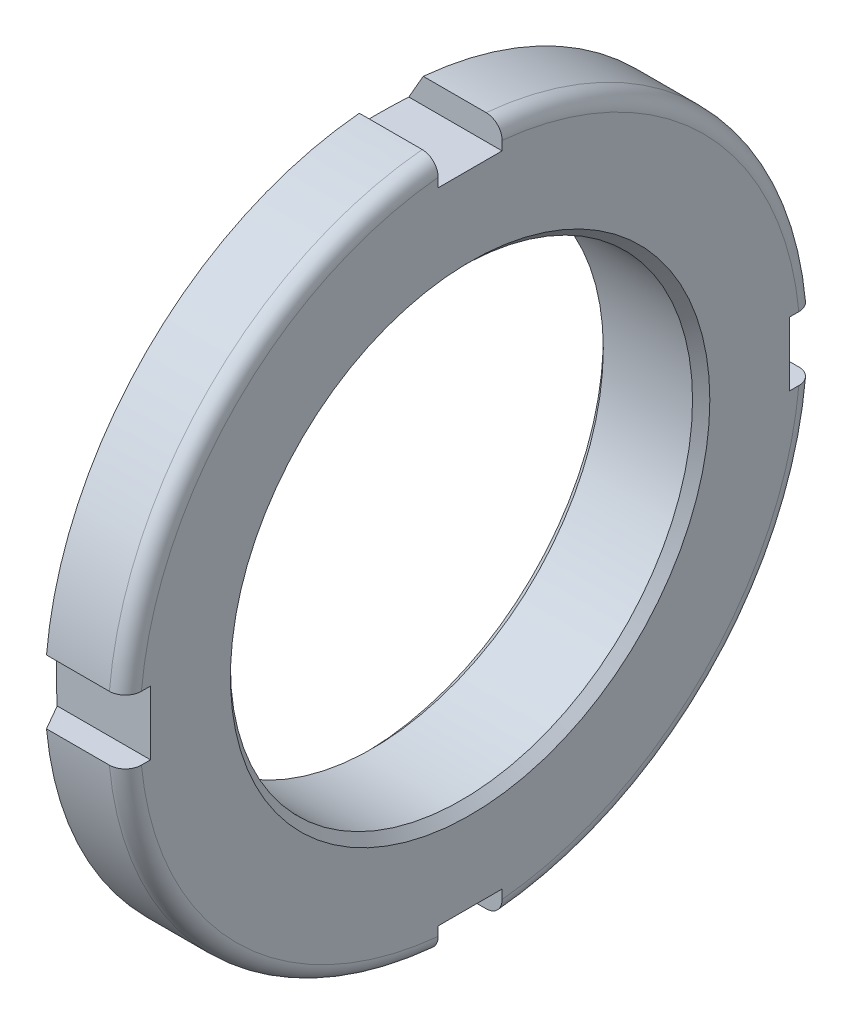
ISO-10303-21;
HEADER;
FILE_DESCRIPTION(('STEP AP214'),'2;1');
FILE_NAME('part.step','',(''),(''),'','','');
FILE_SCHEMA(('AUTOMOTIVE_DESIGN { 1 0 10303 214 1 1 1 1 }'));
ENDSEC;
DATA;
#1=APPLICATION_CONTEXT('core data for automotive mechanical design processes');
#2=APPLICATION_PROTOCOL_DEFINITION('international standard','automotive_design',2000,#1);
#3=PRODUCT_CONTEXT('',#1,'mechanical');
#4=PRODUCT('Part','Part','',(#3));
#5=PRODUCT_RELATED_PRODUCT_CATEGORY('part','',(#4));
#6=PRODUCT_DEFINITION_FORMATION('','',#4);
#7=PRODUCT_DEFINITION_CONTEXT('part definition',#1,'design');
#8=PRODUCT_DEFINITION('design','',#6,#7);
#9=PRODUCT_DEFINITION_SHAPE('','',#8);
#10=(LENGTH_UNIT() NAMED_UNIT(*) SI_UNIT(.MILLI.,.METRE.));
#11=(NAMED_UNIT(*) PLANE_ANGLE_UNIT() SI_UNIT($,.RADIAN.));
#12=(NAMED_UNIT(*) SI_UNIT($,.STERADIAN.) SOLID_ANGLE_UNIT());
#13=UNCERTAINTY_MEASURE_WITH_UNIT(LENGTH_MEASURE(1.E-05),#10,'distance_accuracy_value','');
#14=(GEOMETRIC_REPRESENTATION_CONTEXT(3) GLOBAL_UNCERTAINTY_ASSIGNED_CONTEXT((#13)) GLOBAL_UNIT_ASSIGNED_CONTEXT((#10,
#11,#12)) REPRESENTATION_CONTEXT('',''));
#15=CARTESIAN_POINT('',(0.,0.,0.));
#16=DIRECTION('',(0.,0.,1.));
#17=DIRECTION('',(1.,0.,0.));
#18=AXIS2_PLACEMENT_3D('',#15,#16,#17);
#19=CARTESIAN_POINT('',(0.,0.,0.));
#20=DIRECTION('',(1.,0.,0.));
#21=DIRECTION('',(0.,0.,-1.));
#22=AXIS2_PLACEMENT_3D('',#19,#20,#21);
#23=CYLINDRICAL_SURFACE('',#22,32.5);
#24=DIRECTION('',(1.,0.,0.));
#25=VECTOR('',#24,1.);
#26=CARTESIAN_POINT('',(-0.000999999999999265,3.,32.3612422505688));
#27=LINE('',#26,#25);
#28=CARTESIAN_POINT('',(2.59807621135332,3.,32.3612422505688));
#29=VERTEX_POINT('',#28);
#30=CARTESIAN_POINT('',(8.5,3.,32.3612422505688));
#31=VERTEX_POINT('',#30);
#32=EDGE_CURVE('E176',#29,#31,#27,.T.);
#33=ORIENTED_EDGE('',*,*,#32,.T.);
#34=CARTESIAN_POINT('',(8.5,0.,0.));
#35=DIRECTION('',(1.,0.,0.));
#36=DIRECTION('',(0.,0.,-1.));
#37=AXIS2_PLACEMENT_3D('',#34,#35,#36);
#38=CIRCLE('',#37,32.5);
#39=CARTESIAN_POINT('',(8.5,32.3612422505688,3.));
#40=VERTEX_POINT('',#39);
#41=EDGE_CURVE('E51',#31,#40,#38,.F.);
#42=ORIENTED_EDGE('',*,*,#41,.T.);
#43=DIRECTION('',(1.,0.,0.));
#44=VECTOR('',#43,1.);
#45=CARTESIAN_POINT('',(-0.000999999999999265,32.3612422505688,3.));
#46=LINE('',#45,#44);
#47=CARTESIAN_POINT('',(2.59807621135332,32.3612422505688,3.));
#48=VERTEX_POINT('',#47);
#49=EDGE_CURVE('E196',#48,#40,#46,.T.);
#50=ORIENTED_EDGE('',*,*,#49,.F.);
#51=CARTESIAN_POINT('',(2.59807621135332,0.,0.));
#52=DIRECTION('',(1.,0.,0.));
#53=DIRECTION('',(0.,0.,-1.));
#54=AXIS2_PLACEMENT_3D('',#51,#52,#53);
#55=CIRCLE('',#54,32.5);
#56=EDGE_CURVE('E191',#48,#29,#55,.T.);
#57=ORIENTED_EDGE('',*,*,#56,.T.);
#58=EDGE_LOOP('',(#33,#42,#50,#57));
#59=FACE_BOUND('',#58,.T.);
#60=ADVANCED_FACE('F37',(#59),#23,.T.);
#61=DIRECTION('',(1.,0.,0.));
#62=VECTOR('',#61,1.);
#63=CARTESIAN_POINT('',(-0.000999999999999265,32.3612422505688,-3.));
#64=LINE('',#63,#62);
#65=CARTESIAN_POINT('',(2.59807621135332,32.3612422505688,-3.));
#66=VERTEX_POINT('',#65);
#67=CARTESIAN_POINT('',(8.5,32.3612422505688,-3.));
#68=VERTEX_POINT('',#67);
#69=EDGE_CURVE('E389',#66,#68,#64,.T.);
#70=ORIENTED_EDGE('',*,*,#69,.T.);
#71=CARTESIAN_POINT('',(8.5,0.,0.));
#72=DIRECTION('',(1.,0.,0.));
#73=DIRECTION('',(0.,0.,-1.));
#74=AXIS2_PLACEMENT_3D('',#71,#72,#73);
#75=CIRCLE('',#74,32.5);
#76=CARTESIAN_POINT('',(8.5,3.,-32.3612422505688));
#77=VERTEX_POINT('',#76);
#78=EDGE_CURVE('E331',#68,#77,#75,.F.);
#79=ORIENTED_EDGE('',*,*,#78,.T.);
#80=DIRECTION('',(1.,0.,0.));
#81=VECTOR('',#80,1.);
#82=CARTESIAN_POINT('',(-0.000999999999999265,3.,-32.3612422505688));
#83=LINE('',#82,#81);
#84=CARTESIAN_POINT('',(2.59807621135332,3.,-32.3612422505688));
#85=VERTEX_POINT('',#84);
#86=EDGE_CURVE('E289',#85,#77,#83,.T.);
#87=ORIENTED_EDGE('',*,*,#86,.F.);
#88=EDGE_CURVE('E197',#85,#66,#55,.T.);
#89=ORIENTED_EDGE('',*,*,#88,.T.);
#90=EDGE_LOOP('',(#70,#79,#87,#89));
#91=FACE_BOUND('',#90,.T.);
#92=ADVANCED_FACE('F415',(#91),#23,.T.);
#93=DIRECTION('',(1.,0.,0.));
#94=VECTOR('',#93,1.);
#95=CARTESIAN_POINT('',(-0.000999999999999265,-3.,-32.3612422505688));
#96=LINE('',#95,#94);
#97=CARTESIAN_POINT('',(2.59807621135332,-3.,-32.3612422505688));
#98=VERTEX_POINT('',#97);
#99=CARTESIAN_POINT('',(8.5,-3.,-32.3612422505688));
#100=VERTEX_POINT('',#99);
#101=EDGE_CURVE('E290',#98,#100,#96,.T.);
#102=ORIENTED_EDGE('',*,*,#101,.T.);
#103=CARTESIAN_POINT('',(8.5,0.,0.));
#104=DIRECTION('',(1.,0.,0.));
#105=DIRECTION('',(0.,0.,-1.));
#106=AXIS2_PLACEMENT_3D('',#103,#104,#105);
#107=CIRCLE('',#106,32.5);
#108=CARTESIAN_POINT('',(8.5,-32.3612422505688,-3.));
#109=VERTEX_POINT('',#108);
#110=EDGE_CURVE('E248',#100,#109,#107,.F.);
#111=ORIENTED_EDGE('',*,*,#110,.T.);
#112=DIRECTION('',(1.,0.,0.));
#113=VECTOR('',#112,1.);
#114=CARTESIAN_POINT('',(-0.000999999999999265,-32.3612422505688,-3.));
#115=LINE('',#114,#113);
#116=CARTESIAN_POINT('',(2.59807621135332,-32.3612422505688,-3.));
#117=VERTEX_POINT('',#116);
#118=EDGE_CURVE('E455',#117,#109,#115,.T.);
#119=ORIENTED_EDGE('',*,*,#118,.F.);
#120=EDGE_CURVE('E201',#117,#98,#55,.T.);
#121=ORIENTED_EDGE('',*,*,#120,.T.);
#122=EDGE_LOOP('',(#102,#111,#119,#121));
#123=FACE_BOUND('',#122,.T.);
#124=ADVANCED_FACE('F421',(#123),#23,.T.);
#125=CARTESIAN_POINT('',(2.59807621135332,0.,0.));
#126=DIRECTION('',(1.,0.,0.));
#127=DIRECTION('',(0.,0.,-1.));
#128=AXIS2_PLACEMENT_3D('',#125,#126,#127);
#129=CONICAL_SURFACE('',#128,32.5,1.0471975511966);
#130=CARTESIAN_POINT('',(-0.774586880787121,3.,26.4890358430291));
#131=CARTESIAN_POINT('',(-0.32581777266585,3.,27.2712863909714));
#132=CARTESIAN_POINT('',(0.123132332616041,3.,28.0534330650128));
#133=CARTESIAN_POINT('',(1.02132867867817,3.,29.6175562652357));
#134=CARTESIAN_POINT('',(1.47057491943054,3.,30.3995327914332));
#135=CARTESIAN_POINT('',(2.36929774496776,3.,31.9633534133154));
#136=CARTESIAN_POINT('',(2.81877432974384,3.,32.7451975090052));
#137=CARTESIAN_POINT('',(3.71791618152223,3.,34.3087772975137));
#138=CARTESIAN_POINT('',(4.16758144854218,3.,35.0905129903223));
#139=CARTESIAN_POINT('',(4.61732017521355,3.,35.8722064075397));
#140=B_SPLINE_CURVE_WITH_KNOTS('',3,(#130,#131,#132,#133,#134,#135,#136,#137,#138,#139),
.UNSPECIFIED.,.F.,.F.,(4,2,2,2,4),(0.,2.70551035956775,5.41102046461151,8.11653046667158,
10.8220407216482),.UNSPECIFIED.);
#141=CARTESIAN_POINT('',(1.24108764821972,3.,30.));
#142=VERTEX_POINT('',#141);
#143=EDGE_CURVE('E179',#142,#29,#140,.T.);
#144=ORIENTED_EDGE('',*,*,#143,.T.);
#145=ORIENTED_EDGE('',*,*,#56,.F.);
#146=CARTESIAN_POINT('',(4.61732017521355,35.8722064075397,3.));
#147=CARTESIAN_POINT('',(4.16758144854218,35.0905129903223,3.));
#148=CARTESIAN_POINT('',(3.71791618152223,34.3087772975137,3.));
#149=CARTESIAN_POINT('',(2.81877432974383,32.7451975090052,3.));
#150=CARTESIAN_POINT('',(2.36929774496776,31.9633534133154,3.));
#151=CARTESIAN_POINT('',(1.47057491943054,30.3995327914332,3.));
#152=CARTESIAN_POINT('',(1.02132867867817,29.6175562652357,3.));
#153=CARTESIAN_POINT('',(0.123132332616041,28.0534330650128,3.));
#154=CARTESIAN_POINT('',(-0.32581777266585,27.2712863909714,3.));
#155=CARTESIAN_POINT('',(-0.774586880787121,26.4890358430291,3.));
#156=B_SPLINE_CURVE_WITH_KNOTS('',3,(#146,#147,#148,#149,#150,#151,#152,#153,#154,#155),
.UNSPECIFIED.,.F.,.F.,(4,2,2,2,4),(0.,2.70551025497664,5.41102025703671,8.11653036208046,
10.8220407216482),.UNSPECIFIED.);
#157=CARTESIAN_POINT('',(1.24108764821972,30.,3.));
#158=VERTEX_POINT('',#157);
#159=EDGE_CURVE('E392',#48,#158,#156,.T.);
#160=ORIENTED_EDGE('',*,*,#159,.T.);
#161=CARTESIAN_POINT('',(2.0091193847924,30.,9.53854841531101));
#162=CARTESIAN_POINT('',(1.94715724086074,30.,9.1843653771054));
#163=CARTESIAN_POINT('',(1.88824040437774,30.,8.82965466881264));
#164=CARTESIAN_POINT('',(1.77674003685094,30.,8.11922925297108));
#165=CARTESIAN_POINT('',(1.7241566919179,30.,7.76351451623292));
#166=CARTESIAN_POINT('',(1.57626286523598,30.,6.69487651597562));
#167=CARTESIAN_POINT('',(1.49082542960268,30.,5.98055498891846));
#168=CARTESIAN_POINT('',(1.34796251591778,30.,4.54901032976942));
#169=CARTESIAN_POINT('',(1.29054111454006,30.,3.8317867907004));
#170=CARTESIAN_POINT('',(1.20494432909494,30.,2.39563575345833));
#171=CARTESIAN_POINT('',(1.17676666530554,30.,1.67670839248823));
#172=CARTESIAN_POINT('',(1.15044970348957,30.,0.24783869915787));
#173=CARTESIAN_POINT('',(1.15191712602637,30.,-0.462096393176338));
#174=CARTESIAN_POINT('',(1.18389595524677,30.,-1.88134655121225));
#175=CARTESIAN_POINT('',(1.21440883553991,30.,-2.59066158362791));
#176=CARTESIAN_POINT('',(1.30379852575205,30.,-4.00709347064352));
#177=CARTESIAN_POINT('',(1.362659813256,30.,-4.71421131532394));
#178=CARTESIAN_POINT('',(1.50753008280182,30.,-6.12558663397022));
#179=CARTESIAN_POINT('',(1.59353590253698,30.,-6.82984443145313));
#180=CARTESIAN_POINT('',(1.71583714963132,30.,-7.6997457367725));
#181=CARTESIAN_POINT('',(1.74011054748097,30.,-7.86713611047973));
#182=CARTESIAN_POINT('',(1.79007957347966,30.,-8.20169134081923));
#183=CARTESIAN_POINT('',(1.81577507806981,30.,-8.36885621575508));
#184=CARTESIAN_POINT('',(1.86860796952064,30.,-8.70323687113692));
#185=CARTESIAN_POINT('',(1.89574763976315,30.,-8.87045228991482));
#186=CARTESIAN_POINT('',(1.95140614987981,30.,-9.20466733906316));
#187=CARTESIAN_POINT('',(1.97992510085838,30.,-9.37166695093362));
#188=CARTESIAN_POINT('',(2.0091193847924,30.,-9.53854841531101));
#189=B_SPLINE_CURVE_WITH_KNOTS('',3,(#161,#162,#163,#164,#165,#166,#167,#168,#169,#170,#171,
#172,#173,#174,#175,#176,#177,#178,#179,#180,#181,#182,#183,#184,#185,#186,#187,#188),
.UNSPECIFIED.,.F.,.F.,(4,2,2,2,2,2,2,2,2,2,2,2,2,4),(0.,1.07866075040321,2.15735318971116,
4.31502889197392,6.47301846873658,8.63083980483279,10.7600539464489,12.889376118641,
15.0175336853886,17.145443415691,17.652864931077,18.1602424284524,18.668447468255,
19.1766935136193),.UNSPECIFIED.);
#190=CARTESIAN_POINT('',(1.24108764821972,30.,-3.));
#191=VERTEX_POINT('',#190);
#192=EDGE_CURVE('E376',#158,#191,#189,.T.);
#193=ORIENTED_EDGE('',*,*,#192,.T.);
#194=CARTESIAN_POINT('',(-0.774586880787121,26.4890358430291,-3.));
#195=CARTESIAN_POINT('',(-0.32581777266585,27.2712863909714,-3.));
#196=CARTESIAN_POINT('',(0.123132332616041,28.0534330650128,-3.));
#197=CARTESIAN_POINT('',(1.02132867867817,29.6175562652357,-3.));
#198=CARTESIAN_POINT('',(1.47057491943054,30.3995327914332,-3.));
#199=CARTESIAN_POINT('',(2.36929774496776,31.9633534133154,-3.));
#200=CARTESIAN_POINT('',(2.81877432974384,32.7451975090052,-3.));
#201=CARTESIAN_POINT('',(3.71791618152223,34.3087772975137,-3.));
#202=CARTESIAN_POINT('',(4.16758144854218,35.0905129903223,-3.));
#203=CARTESIAN_POINT('',(4.61732017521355,35.8722064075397,-3.));
#204=B_SPLINE_CURVE_WITH_KNOTS('',3,(#194,#195,#196,#197,#198,#199,#200,#201,#202,#203),
.UNSPECIFIED.,.F.,.F.,(4,2,2,2,4),(0.,2.70551035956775,5.41102046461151,8.11653046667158,
10.8220407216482),.UNSPECIFIED.);
#205=EDGE_CURVE('E367',#191,#66,#204,.T.);
#206=ORIENTED_EDGE('',*,*,#205,.T.);
#207=ORIENTED_EDGE('',*,*,#88,.F.);
#208=CARTESIAN_POINT('',(4.61732017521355,3.,-35.8722064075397));
#209=CARTESIAN_POINT('',(4.16758144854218,3.,-35.0905129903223));
#210=CARTESIAN_POINT('',(3.71791618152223,3.,-34.3087772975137));
#211=CARTESIAN_POINT('',(2.81877432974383,3.,-32.7451975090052));
#212=CARTESIAN_POINT('',(2.36929774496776,3.,-31.9633534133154));
#213=CARTESIAN_POINT('',(1.47057491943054,3.,-30.3995327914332));
#214=CARTESIAN_POINT('',(1.02132867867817,3.,-29.6175562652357));
#215=CARTESIAN_POINT('',(0.123132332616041,3.,-28.0534330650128));
#216=CARTESIAN_POINT('',(-0.32581777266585,3.,-27.2712863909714));
#217=CARTESIAN_POINT('',(-0.774586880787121,3.,-26.4890358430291));
#218=B_SPLINE_CURVE_WITH_KNOTS('',3,(#208,#209,#210,#211,#212,#213,#214,#215,#216,#217),
.UNSPECIFIED.,.F.,.F.,(4,2,2,2,4),(0.,2.70551025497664,5.41102025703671,8.11653036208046,
10.8220407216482),.UNSPECIFIED.);
#219=CARTESIAN_POINT('',(1.24108764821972,3.,-30.));
#220=VERTEX_POINT('',#219);
#221=EDGE_CURVE('E293',#85,#220,#218,.T.);
#222=ORIENTED_EDGE('',*,*,#221,.T.);
#223=CARTESIAN_POINT('',(2.0091193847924,9.53854841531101,-30.));
#224=CARTESIAN_POINT('',(1.94715724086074,9.1843653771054,-30.));
#225=CARTESIAN_POINT('',(1.88824040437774,8.82965466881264,-30.));
#226=CARTESIAN_POINT('',(1.77674003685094,8.11922925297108,-30.));
#227=CARTESIAN_POINT('',(1.7241566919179,7.76351451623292,-30.));
#228=CARTESIAN_POINT('',(1.57626286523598,6.69487651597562,-30.));
#229=CARTESIAN_POINT('',(1.49082542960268,5.98055498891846,-30.));
#230=CARTESIAN_POINT('',(1.34796251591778,4.54901032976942,-30.));
#231=CARTESIAN_POINT('',(1.29054111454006,3.8317867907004,-30.));
#232=CARTESIAN_POINT('',(1.20494432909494,2.39563575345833,-30.));
#233=CARTESIAN_POINT('',(1.17676666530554,1.67670839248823,-30.));
#234=CARTESIAN_POINT('',(1.15044970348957,0.24783869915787,-30.));
#235=CARTESIAN_POINT('',(1.15191712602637,-0.462096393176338,-30.));
#236=CARTESIAN_POINT('',(1.18389595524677,-1.88134655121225,-30.));
#237=CARTESIAN_POINT('',(1.21440883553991,-2.59066158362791,-30.));
#238=CARTESIAN_POINT('',(1.30379852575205,-4.00709347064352,-30.));
#239=CARTESIAN_POINT('',(1.362659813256,-4.71421131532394,-30.));
#240=CARTESIAN_POINT('',(1.50753008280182,-6.12558663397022,-30.));
#241=CARTESIAN_POINT('',(1.59353590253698,-6.82984443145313,-30.));
#242=CARTESIAN_POINT('',(1.71583714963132,-7.6997457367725,-30.));
#243=CARTESIAN_POINT('',(1.74011054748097,-7.86713611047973,-30.));
#244=CARTESIAN_POINT('',(1.79007957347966,-8.20169134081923,-30.));
#245=CARTESIAN_POINT('',(1.81577507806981,-8.36885621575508,-30.));
#246=CARTESIAN_POINT('',(1.86860796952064,-8.70323687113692,-30.));
#247=CARTESIAN_POINT('',(1.89574763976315,-8.87045228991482,-30.));
#248=CARTESIAN_POINT('',(1.95140614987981,-9.20466733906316,-30.));
#249=CARTESIAN_POINT('',(1.97992510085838,-9.37166695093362,-30.));
#250=CARTESIAN_POINT('',(2.0091193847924,-9.53854841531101,-30.));
#251=B_SPLINE_CURVE_WITH_KNOTS('',3,(#223,#224,#225,#226,#227,#228,#229,#230,#231,#232,#233,
#234,#235,#236,#237,#238,#239,#240,#241,#242,#243,#244,#245,#246,#247,#248,#249,#250),
.UNSPECIFIED.,.F.,.F.,(4,2,2,2,2,2,2,2,2,2,2,2,2,4),(0.,1.07866075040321,2.15735318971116,
4.31502889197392,6.47301846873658,8.63083980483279,10.7600539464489,12.889376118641,
15.0175336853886,17.145443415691,17.652864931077,18.1602424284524,18.668447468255,
19.1766935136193),.UNSPECIFIED.);
#252=CARTESIAN_POINT('',(1.24108764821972,-3.,-30.));
#253=VERTEX_POINT('',#252);
#254=EDGE_CURVE('E276',#220,#253,#251,.T.);
#255=ORIENTED_EDGE('',*,*,#254,.T.);
#256=CARTESIAN_POINT('',(-0.774586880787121,-3.,-26.4890358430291));
#257=CARTESIAN_POINT('',(-0.325817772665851,-3.,-27.2712863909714));
#258=CARTESIAN_POINT('',(0.12313233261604,-3.,-28.0534330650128));
#259=CARTESIAN_POINT('',(1.02132867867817,-3.,-29.6175562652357));
#260=CARTESIAN_POINT('',(1.47057491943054,-3.,-30.3995327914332));
#261=CARTESIAN_POINT('',(2.36929774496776,-3.,-31.9633534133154));
#262=CARTESIAN_POINT('',(2.81877432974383,-3.,-32.7451975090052));
#263=CARTESIAN_POINT('',(3.71791618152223,-3.,-34.3087772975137));
#264=CARTESIAN_POINT('',(4.16758144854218,-3.,-35.0905129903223));
#265=CARTESIAN_POINT('',(4.61732017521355,-3.,-35.8722064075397));
#266=B_SPLINE_CURVE_WITH_KNOTS('',3,(#256,#257,#258,#259,#260,#261,#262,#263,#264,#265),
.UNSPECIFIED.,.F.,.F.,(4,2,2,2,4),(0.,2.70551035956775,5.4110204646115,8.11653046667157,
10.8220407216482),.UNSPECIFIED.);
#267=EDGE_CURVE('E267',#253,#98,#266,.T.);
#268=ORIENTED_EDGE('',*,*,#267,.T.);
#269=ORIENTED_EDGE('',*,*,#120,.F.);
#270=CARTESIAN_POINT('',(4.61732017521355,-35.8722064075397,-3.));
#271=CARTESIAN_POINT('',(4.16758144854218,-35.0905129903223,-3.));
#272=CARTESIAN_POINT('',(3.71791618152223,-34.3087772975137,-3.));
#273=CARTESIAN_POINT('',(2.81877432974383,-32.7451975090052,-3.));
#274=CARTESIAN_POINT('',(2.36929774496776,-31.9633534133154,-3.));
#275=CARTESIAN_POINT('',(1.47057491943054,-30.3995327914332,-3.));
#276=CARTESIAN_POINT('',(1.02132867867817,-29.6175562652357,-3.));
#277=CARTESIAN_POINT('',(0.123132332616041,-28.0534330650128,-3.));
#278=CARTESIAN_POINT('',(-0.32581777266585,-27.2712863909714,-3.));
#279=CARTESIAN_POINT('',(-0.774586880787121,-26.4890358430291,-3.));
#280=B_SPLINE_CURVE_WITH_KNOTS('',3,(#270,#271,#272,#273,#274,#275,#276,#277,#278,#279),
.UNSPECIFIED.,.F.,.F.,(4,2,2,2,4),(0.,2.70551025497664,5.41102025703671,8.11653036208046,
10.8220407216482),.UNSPECIFIED.);
#281=CARTESIAN_POINT('',(1.24108764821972,-30.,-3.));
#282=VERTEX_POINT('',#281);
#283=EDGE_CURVE('E202',#117,#282,#280,.T.);
#284=ORIENTED_EDGE('',*,*,#283,.T.);
#285=CARTESIAN_POINT('',(2.0091193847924,-30.,-9.53854841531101));
#286=CARTESIAN_POINT('',(1.94715724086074,-30.,-9.1843653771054));
#287=CARTESIAN_POINT('',(1.88824040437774,-30.,-8.82965466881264));
#288=CARTESIAN_POINT('',(1.77674003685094,-30.,-8.11922925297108));
#289=CARTESIAN_POINT('',(1.7241566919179,-30.,-7.76351451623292));
#290=CARTESIAN_POINT('',(1.57626286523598,-30.,-6.69487651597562));
#291=CARTESIAN_POINT('',(1.49082542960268,-30.,-5.98055498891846));
#292=CARTESIAN_POINT('',(1.34796251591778,-30.,-4.54901032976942));
#293=CARTESIAN_POINT('',(1.29054111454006,-30.,-3.8317867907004));
#294=CARTESIAN_POINT('',(1.20494432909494,-30.,-2.39563575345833));
#295=CARTESIAN_POINT('',(1.17676666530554,-30.,-1.67670839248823));
#296=CARTESIAN_POINT('',(1.15044970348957,-30.,-0.24783869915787));
#297=CARTESIAN_POINT('',(1.15191712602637,-30.,0.462096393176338));
#298=CARTESIAN_POINT('',(1.18389595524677,-30.,1.88134655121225));
#299=CARTESIAN_POINT('',(1.21440883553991,-30.,2.59066158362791));
#300=CARTESIAN_POINT('',(1.30379852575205,-30.,4.00709347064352));
#301=CARTESIAN_POINT('',(1.362659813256,-30.,4.71421131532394));
#302=CARTESIAN_POINT('',(1.50753008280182,-30.,6.12558663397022));
#303=CARTESIAN_POINT('',(1.59353590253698,-30.,6.82984443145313));
#304=CARTESIAN_POINT('',(1.71583714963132,-30.,7.6997457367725));
#305=CARTESIAN_POINT('',(1.74011054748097,-30.,7.86713611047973));
#306=CARTESIAN_POINT('',(1.79007957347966,-30.,8.20169134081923));
#307=CARTESIAN_POINT('',(1.81577507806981,-30.,8.36885621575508));
#308=CARTESIAN_POINT('',(1.86860796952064,-30.,8.70323687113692));
#309=CARTESIAN_POINT('',(1.89574763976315,-30.,8.87045228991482));
#310=CARTESIAN_POINT('',(1.95140614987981,-30.,9.20466733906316));
#311=CARTESIAN_POINT('',(1.97992510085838,-30.,9.37166695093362));
#312=CARTESIAN_POINT('',(2.0091193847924,-30.,9.53854841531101));
#313=B_SPLINE_CURVE_WITH_KNOTS('',3,(#285,#286,#287,#288,#289,#290,#291,#292,#293,#294,#295,
#296,#297,#298,#299,#300,#301,#302,#303,#304,#305,#306,#307,#308,#309,#310,#311,#312),
.UNSPECIFIED.,.F.,.F.,(4,2,2,2,2,2,2,2,2,2,2,2,2,4),(0.,1.07866075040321,2.15735318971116,
4.31502889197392,6.47301846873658,8.63083980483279,10.7600539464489,12.889376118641,
15.0175336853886,17.145443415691,17.652864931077,18.1602424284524,18.668447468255,
19.1766935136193),.UNSPECIFIED.);
#314=CARTESIAN_POINT('',(1.24108764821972,-30.,3.));
#315=VERTEX_POINT('',#314);
#316=EDGE_CURVE('E307',#282,#315,#313,.T.);
#317=ORIENTED_EDGE('',*,*,#316,.T.);
#318=CARTESIAN_POINT('',(-0.77458688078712,-26.4890358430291,3.));
#319=CARTESIAN_POINT('',(-0.32581777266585,-27.2712863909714,3.));
#320=CARTESIAN_POINT('',(0.12313233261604,-28.0534330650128,3.));
#321=CARTESIAN_POINT('',(1.02132867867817,-29.6175562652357,3.));
#322=CARTESIAN_POINT('',(1.47057491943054,-30.3995327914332,3.));
#323=CARTESIAN_POINT('',(2.36929774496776,-31.9633534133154,3.));
#324=CARTESIAN_POINT('',(2.81877432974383,-32.7451975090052,3.));
#325=CARTESIAN_POINT('',(3.71791618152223,-34.3087772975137,3.));
#326=CARTESIAN_POINT('',(4.16758144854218,-35.0905129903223,3.));
#327=CARTESIAN_POINT('',(4.61732017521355,-35.8722064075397,3.));
#328=B_SPLINE_CURVE_WITH_KNOTS('',3,(#318,#319,#320,#321,#322,#323,#324,#325,#326,#327),
.UNSPECIFIED.,.F.,.F.,(4,2,2,2,4),(0.,2.70551035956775,5.4110204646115,8.11653046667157,
10.8220407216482),.UNSPECIFIED.);
#329=CARTESIAN_POINT('',(2.59807621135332,-32.3612422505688,3.));
#330=VERTEX_POINT('',#329);
#331=EDGE_CURVE('E462',#315,#330,#328,.T.);
#332=ORIENTED_EDGE('',*,*,#331,.T.);
#333=CARTESIAN_POINT('',(2.59807621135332,-3.,32.3612422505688));
#334=VERTEX_POINT('',#333);
#335=EDGE_CURVE('E198',#334,#330,#55,.T.);
#336=ORIENTED_EDGE('',*,*,#335,.F.);
#337=CARTESIAN_POINT('',(4.61732017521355,-3.,35.8722064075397));
#338=CARTESIAN_POINT('',(4.16758144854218,-3.,35.0905129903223));
#339=CARTESIAN_POINT('',(3.71791618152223,-3.,34.3087772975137));
#340=CARTESIAN_POINT('',(2.81877432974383,-3.,32.7451975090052));
#341=CARTESIAN_POINT('',(2.36929774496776,-3.,31.9633534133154));
#342=CARTESIAN_POINT('',(1.47057491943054,-3.,30.3995327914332));
#343=CARTESIAN_POINT('',(1.02132867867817,-3.,29.6175562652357));
#344=CARTESIAN_POINT('',(0.123132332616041,-3.,28.0534330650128));
#345=CARTESIAN_POINT('',(-0.32581777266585,-3.,27.2712863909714));
#346=CARTESIAN_POINT('',(-0.774586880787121,-3.,26.4890358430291));
#347=B_SPLINE_CURVE_WITH_KNOTS('',3,(#337,#338,#339,#340,#341,#342,#343,#344,#345,#346),
.UNSPECIFIED.,.F.,.F.,(4,2,2,2,4),(0.,2.70551025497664,5.41102025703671,8.11653036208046,
10.8220407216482),.UNSPECIFIED.);
#348=CARTESIAN_POINT('',(1.24108764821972,-3.,30.));
#349=VERTEX_POINT('',#348);
#350=EDGE_CURVE('E182',#334,#349,#347,.T.);
#351=ORIENTED_EDGE('',*,*,#350,.T.);
#352=CARTESIAN_POINT('',(2.0091193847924,-9.53854841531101,30.));
#353=CARTESIAN_POINT('',(1.94715724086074,-9.1843653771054,30.));
#354=CARTESIAN_POINT('',(1.88824040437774,-8.82965466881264,30.));
#355=CARTESIAN_POINT('',(1.77674003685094,-8.11922925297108,30.));
#356=CARTESIAN_POINT('',(1.7241566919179,-7.76351451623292,30.));
#357=CARTESIAN_POINT('',(1.57626286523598,-6.69487651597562,30.));
#358=CARTESIAN_POINT('',(1.49082542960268,-5.98055498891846,30.));
#359=CARTESIAN_POINT('',(1.34796251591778,-4.54901032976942,30.));
#360=CARTESIAN_POINT('',(1.29054111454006,-3.8317867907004,30.));
#361=CARTESIAN_POINT('',(1.20494432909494,-2.39563575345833,30.));
#362=CARTESIAN_POINT('',(1.17676666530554,-1.67670839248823,30.));
#363=CARTESIAN_POINT('',(1.15044970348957,-0.24783869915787,30.));
#364=CARTESIAN_POINT('',(1.15191712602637,0.462096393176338,30.));
#365=CARTESIAN_POINT('',(1.18389595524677,1.88134655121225,30.));
#366=CARTESIAN_POINT('',(1.21440883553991,2.59066158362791,30.));
#367=CARTESIAN_POINT('',(1.30379852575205,4.00709347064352,30.));
#368=CARTESIAN_POINT('',(1.362659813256,4.71421131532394,30.));
#369=CARTESIAN_POINT('',(1.50753008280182,6.12558663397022,30.));
#370=CARTESIAN_POINT('',(1.59353590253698,6.82984443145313,30.));
#371=CARTESIAN_POINT('',(1.71583714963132,7.6997457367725,30.));
#372=CARTESIAN_POINT('',(1.74011054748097,7.86713611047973,30.));
#373=CARTESIAN_POINT('',(1.79007957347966,8.20169134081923,30.));
#374=CARTESIAN_POINT('',(1.81577507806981,8.36885621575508,30.));
#375=CARTESIAN_POINT('',(1.86860796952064,8.70323687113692,30.));
#376=CARTESIAN_POINT('',(1.89574763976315,8.87045228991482,30.));
#377=CARTESIAN_POINT('',(1.95140614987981,9.20466733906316,30.));
#378=CARTESIAN_POINT('',(1.97992510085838,9.37166695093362,30.));
#379=CARTESIAN_POINT('',(2.0091193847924,9.53854841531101,30.));
#380=B_SPLINE_CURVE_WITH_KNOTS('',3,(#352,#353,#354,#355,#356,#357,#358,#359,#360,#361,#362,
#363,#364,#365,#366,#367,#368,#369,#370,#371,#372,#373,#374,#375,#376,#377,#378,#379),
.UNSPECIFIED.,.F.,.F.,(4,2,2,2,2,2,2,2,2,2,2,2,2,4),(0.,1.07866075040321,2.15735318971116,
4.31502889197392,6.47301846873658,8.63083980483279,10.7600539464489,12.889376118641,
15.0175336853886,17.145443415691,17.652864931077,18.1602424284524,18.668447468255,
19.1766935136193),.UNSPECIFIED.);
#381=EDGE_CURVE('E193',#349,#142,#380,.T.);
#382=ORIENTED_EDGE('',*,*,#381,.T.);
#383=EDGE_LOOP('',(#144,#145,#160,#193,#206,#207,#222,#255,#268,#269,#284,#317,#332,#336,#351,#382));
#384=FACE_BOUND('',#383,.T.);
#385=CARTESIAN_POINT('',(0.,0.,0.));
#386=DIRECTION('',(1.,0.,0.));
#387=DIRECTION('',(0.,0.,-1.));
#388=AXIS2_PLACEMENT_3D('',#385,#386,#387);
#389=CIRCLE('',#388,28.);
#390=CARTESIAN_POINT('',(0.,0.,-28.));
#391=VERTEX_POINT('',#390);
#392=EDGE_CURVE('E206',#391,#391,#389,.T.);
#393=ORIENTED_EDGE('',*,*,#392,.T.);
#394=EDGE_LOOP('',(#393));
#395=FACE_BOUND('',#394,.T.);
#396=ADVANCED_FACE('F188',(#384,#395),#129,.T.);
#397=CARTESIAN_POINT('',(0.,28.,0.));
#398=DIRECTION('',(-1.,0.,0.));
#399=DIRECTION('',(0.,0.,1.));
#400=AXIS2_PLACEMENT_3D('',#397,#398,#399);
#401=PLANE('',#400);
#402=CARTESIAN_POINT('',(0.,0.,0.));
#403=DIRECTION('',(-1.,0.,0.));
#404=DIRECTION('',(0.,0.,1.));
#405=AXIS2_PLACEMENT_3D('',#402,#403,#404);
#406=CIRCLE('',#405,22.5);
#407=CARTESIAN_POINT('',(0.,0.,22.5));
#408=VERTEX_POINT('',#407);
#409=EDGE_CURVE('E225',#408,#408,#406,.F.);
#410=ORIENTED_EDGE('',*,*,#409,.T.);
#411=EDGE_LOOP('',(#410));
#412=FACE_BOUND('',#411,.T.);
#413=ORIENTED_EDGE('',*,*,#392,.F.);
#414=EDGE_LOOP('',(#413));
#415=FACE_BOUND('',#414,.T.);
#416=ADVANCED_FACE('F434',(#412,#415),#401,.T.);
#417=CARTESIAN_POINT('',(10.,0.,0.));
#418=DIRECTION('',(1.,0.,0.));
#419=DIRECTION('',(0.,0.,-1.));
#420=AXIS2_PLACEMENT_3D('',#417,#418,#419);
#421=PLANE('',#420);
#422=CARTESIAN_POINT('',(10.,0.,0.));
#423=DIRECTION('',(1.,0.,0.));
#424=DIRECTION('',(0.,0.,-1.));
#425=AXIS2_PLACEMENT_3D('',#422,#423,#424);
#426=CIRCLE('',#425,22.5);
#427=CARTESIAN_POINT('',(10.,0.,-22.5));
#428=VERTEX_POINT('',#427);
#429=EDGE_CURVE('E216',#428,#428,#426,.F.);
#430=ORIENTED_EDGE('',*,*,#429,.T.);
#431=EDGE_LOOP('',(#430));
#432=FACE_BOUND('',#431,.T.);
#433=DIRECTION('',(0.,1.,0.));
#434=VECTOR('',#433,1.);
#435=CARTESIAN_POINT('',(10.,-32.3612422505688,-3.));
#436=LINE('',#435,#434);
#437=CARTESIAN_POINT('',(10.,-30.854497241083,-3.));
#438=VERTEX_POINT('',#437);
#439=CARTESIAN_POINT('',(10.,-30.,-3.));
#440=VERTEX_POINT('',#439);
#441=EDGE_CURVE('E453',#438,#440,#436,.T.);
#442=ORIENTED_EDGE('',*,*,#441,.F.);
#443=CARTESIAN_POINT('',(10.,0.,0.));
#444=DIRECTION('',(1.,0.,0.));
#445=DIRECTION('',(0.,0.,-1.));
#446=AXIS2_PLACEMENT_3D('',#443,#444,#445);
#447=CIRCLE('',#446,31.);
#448=CARTESIAN_POINT('',(10.,-3.,-30.854497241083));
#449=VERTEX_POINT('',#448);
#450=EDGE_CURVE('E237',#438,#449,#447,.T.);
#451=ORIENTED_EDGE('',*,*,#450,.T.);
#452=DIRECTION('',(0.,0.,-1.));
#453=VECTOR('',#452,1.);
#454=CARTESIAN_POINT('',(10.,-3.,-30.));
#455=LINE('',#454,#453);
#456=CARTESIAN_POINT('',(10.,-3.,-30.));
#457=VERTEX_POINT('',#456);
#458=EDGE_CURVE('E286',#457,#449,#455,.T.);
#459=ORIENTED_EDGE('',*,*,#458,.F.);
#460=DIRECTION('',(0.,-1.,0.));
#461=VECTOR('',#460,1.);
#462=CARTESIAN_POINT('',(10.,3.,-30.));
#463=LINE('',#462,#461);
#464=CARTESIAN_POINT('',(10.,3.,-30.));
#465=VERTEX_POINT('',#464);
#466=EDGE_CURVE('E283',#465,#457,#463,.T.);
#467=ORIENTED_EDGE('',*,*,#466,.F.);
#468=DIRECTION('',(0.,0.,1.));
#469=VECTOR('',#468,1.);
#470=CARTESIAN_POINT('',(10.,3.,-32.3612422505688));
#471=LINE('',#470,#469);
#472=CARTESIAN_POINT('',(10.,3.,-30.854497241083));
#473=VERTEX_POINT('',#472);
#474=EDGE_CURVE('E275',#473,#465,#471,.T.);
#475=ORIENTED_EDGE('',*,*,#474,.F.);
#476=CARTESIAN_POINT('',(10.,0.,0.));
#477=DIRECTION('',(1.,0.,0.));
#478=DIRECTION('',(0.,0.,-1.));
#479=AXIS2_PLACEMENT_3D('',#476,#477,#478);
#480=CIRCLE('',#479,31.);
#481=CARTESIAN_POINT('',(10.,30.854497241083,-3.));
#482=VERTEX_POINT('',#481);
#483=EDGE_CURVE('E234',#473,#482,#480,.T.);
#484=ORIENTED_EDGE('',*,*,#483,.T.);
#485=DIRECTION('',(0.,1.,0.));
#486=VECTOR('',#485,1.);
#487=CARTESIAN_POINT('',(10.,30.,-3.));
#488=LINE('',#487,#486);
#489=CARTESIAN_POINT('',(10.,30.,-3.));
#490=VERTEX_POINT('',#489);
#491=EDGE_CURVE('E386',#490,#482,#488,.T.);
#492=ORIENTED_EDGE('',*,*,#491,.F.);
#493=DIRECTION('',(0.,0.,-1.));
#494=VECTOR('',#493,1.);
#495=CARTESIAN_POINT('',(10.,30.,3.));
#496=LINE('',#495,#494);
#497=CARTESIAN_POINT('',(10.,30.,3.));
#498=VERTEX_POINT('',#497);
#499=EDGE_CURVE('E383',#498,#490,#496,.T.);
#500=ORIENTED_EDGE('',*,*,#499,.F.);
#501=DIRECTION('',(0.,-1.,0.));
#502=VECTOR('',#501,1.);
#503=CARTESIAN_POINT('',(10.,32.3612422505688,3.));
#504=LINE('',#503,#502);
#505=CARTESIAN_POINT('',(10.,30.854497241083,3.));
#506=VERTEX_POINT('',#505);
#507=EDGE_CURVE('E375',#506,#498,#504,.T.);
#508=ORIENTED_EDGE('',*,*,#507,.F.);
#509=CARTESIAN_POINT('',(10.,0.,0.));
#510=DIRECTION('',(1.,0.,0.));
#511=DIRECTION('',(0.,0.,-1.));
#512=AXIS2_PLACEMENT_3D('',#509,#510,#511);
#513=CIRCLE('',#512,31.);
#514=CARTESIAN_POINT('',(10.,3.,30.854497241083));
#515=VERTEX_POINT('',#514);
#516=EDGE_CURVE('E228',#506,#515,#513,.T.);
#517=ORIENTED_EDGE('',*,*,#516,.T.);
#518=DIRECTION('',(0.,0.,1.));
#519=VECTOR('',#518,1.);
#520=CARTESIAN_POINT('',(10.,3.,30.));
#521=LINE('',#520,#519);
#522=CARTESIAN_POINT('',(10.,3.,30.));
#523=VERTEX_POINT('',#522);
#524=EDGE_CURVE('E537',#523,#515,#521,.T.);
#525=ORIENTED_EDGE('',*,*,#524,.F.);
#526=DIRECTION('',(0.,1.,0.));
#527=VECTOR('',#526,1.);
#528=CARTESIAN_POINT('',(10.,-3.,30.));
#529=LINE('',#528,#527);
#530=CARTESIAN_POINT('',(10.,-3.,30.));
#531=VERTEX_POINT('',#530);
#532=EDGE_CURVE('E534',#531,#523,#529,.T.);
#533=ORIENTED_EDGE('',*,*,#532,.F.);
#534=DIRECTION('',(0.,0.,-1.));
#535=VECTOR('',#534,1.);
#536=CARTESIAN_POINT('',(10.,-3.,32.3612422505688));
#537=LINE('',#536,#535);
#538=CARTESIAN_POINT('',(10.,-3.,30.854497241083));
#539=VERTEX_POINT('',#538);
#540=EDGE_CURVE('E194',#539,#531,#537,.T.);
#541=ORIENTED_EDGE('',*,*,#540,.F.);
#542=CARTESIAN_POINT('',(10.,0.,0.));
#543=DIRECTION('',(1.,0.,0.));
#544=DIRECTION('',(0.,0.,-1.));
#545=AXIS2_PLACEMENT_3D('',#542,#543,#544);
#546=CIRCLE('',#545,31.);
#547=CARTESIAN_POINT('',(10.,-30.854497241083,3.));
#548=VERTEX_POINT('',#547);
#549=EDGE_CURVE('E231',#539,#548,#546,.T.);
#550=ORIENTED_EDGE('',*,*,#549,.T.);
#551=DIRECTION('',(0.,-1.,0.));
#552=VECTOR('',#551,1.);
#553=CARTESIAN_POINT('',(10.,-30.,3.));
#554=LINE('',#553,#552);
#555=CARTESIAN_POINT('',(10.,-30.,3.));
#556=VERTEX_POINT('',#555);
#557=EDGE_CURVE('E464',#556,#548,#554,.T.);
#558=ORIENTED_EDGE('',*,*,#557,.F.);
#559=DIRECTION('',(0.,0.,1.));
#560=VECTOR('',#559,1.);
#561=CARTESIAN_POINT('',(10.,-30.,-3.));
#562=LINE('',#561,#560);
#563=EDGE_CURVE('E461',#440,#556,#562,.T.);
#564=ORIENTED_EDGE('',*,*,#563,.F.);
#565=EDGE_LOOP('',(#442,#451,#459,#467,#475,#484,#492,#500,#508,#517,#525,#533,#541,#550,#558,#564));
#566=FACE_BOUND('',#565,.T.);
#567=ADVANCED_FACE('F426',(#432,#566),#421,.T.);
#568=DIRECTION('',(1.,0.,0.));
#569=VECTOR('',#568,1.);
#570=CARTESIAN_POINT('',(-0.000999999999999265,-32.3612422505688,3.));
#571=LINE('',#570,#569);
#572=CARTESIAN_POINT('',(8.5,-32.3612422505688,3.));
#573=VERTEX_POINT('',#572);
#574=EDGE_CURVE('E474',#330,#573,#571,.T.);
#575=ORIENTED_EDGE('',*,*,#574,.T.);
#576=CARTESIAN_POINT('',(8.5,0.,0.));
#577=DIRECTION('',(1.,0.,0.));
#578=DIRECTION('',(0.,0.,-1.));
#579=AXIS2_PLACEMENT_3D('',#576,#577,#578);
#580=CIRCLE('',#579,32.5);
#581=CARTESIAN_POINT('',(8.5,-3.,32.3612422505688));
#582=VERTEX_POINT('',#581);
#583=EDGE_CURVE('E506',#573,#582,#580,.F.);
#584=ORIENTED_EDGE('',*,*,#583,.T.);
#585=DIRECTION('',(1.,0.,0.));
#586=VECTOR('',#585,1.);
#587=CARTESIAN_POINT('',(-0.000999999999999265,-3.,32.3612422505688));
#588=LINE('',#587,#586);
#589=EDGE_CURVE('E538',#334,#582,#588,.T.);
#590=ORIENTED_EDGE('',*,*,#589,.F.);
#591=ORIENTED_EDGE('',*,*,#335,.T.);
#592=EDGE_LOOP('',(#575,#584,#590,#591));
#593=FACE_BOUND('',#592,.T.);
#594=ADVANCED_FACE('F417',(#593),#23,.T.);
#595=CARTESIAN_POINT('',(-0.000999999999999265,-30.,3.));
#596=DIRECTION('',(0.,0.,1.));
#597=DIRECTION('',(1.,0.,0.));
#598=AXIS2_PLACEMENT_3D('',#595,#596,#597);
#599=PLANE('',#598);
#600=ORIENTED_EDGE('',*,*,#557,.T.);
#601=CARTESIAN_POINT('',(10.,-30.854497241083,3.));
#602=CARTESIAN_POINT('',(9.9999996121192,-30.8970321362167,3.));
#603=CARTESIAN_POINT('',(9.99820660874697,-30.9395467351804,3.));
#604=CARTESIAN_POINT('',(9.99105245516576,-31.0242730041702,3.));
#605=CARTESIAN_POINT('',(9.98569143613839,-31.0664846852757,3.));
#606=CARTESIAN_POINT('',(9.9643033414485,-31.1921499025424,3.));
#607=CARTESIAN_POINT('',(9.94297110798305,-31.2747636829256,3.));
#608=CARTESIAN_POINT('',(9.88673218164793,-31.4352377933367,3.));
#609=CARTESIAN_POINT('',(9.85181822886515,-31.5130955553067,3.));
#610=CARTESIAN_POINT('',(9.76939024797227,-31.6618213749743,3.));
#611=CARTESIAN_POINT('',(9.72187896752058,-31.7326909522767,3.));
#612=CARTESIAN_POINT('',(9.61570772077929,-31.8652506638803,3.));
#613=CARTESIAN_POINT('',(9.55707330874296,-31.9269612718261,3.));
#614=CARTESIAN_POINT('',(9.43022198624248,-32.03962482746,3.));
#615=CARTESIAN_POINT('',(9.36200327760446,-32.0905757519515,3.));
#616=CARTESIAN_POINT('',(9.21823840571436,-32.1800319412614,3.));
#617=CARTESIAN_POINT('',(9.14272325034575,-32.2185871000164,3.));
#618=CARTESIAN_POINT('',(8.98629127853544,-32.2823955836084,3.));
#619=CARTESIAN_POINT('',(8.9053779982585,-32.3076575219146,3.));
#620=CARTESIAN_POINT('',(8.76994525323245,-32.3376523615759,3.));
#621=CARTESIAN_POINT('',(8.71630027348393,-32.3464933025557,3.));
#622=CARTESIAN_POINT('',(8.60844460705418,-32.358287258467,3.));
#623=CARTESIAN_POINT('',(8.55423483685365,-32.3612486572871,3.));
#624=CARTESIAN_POINT('',(8.5,-32.3612422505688,3.));
#625=B_SPLINE_CURVE_WITH_KNOTS('',3,(#601,#602,#603,#604,#605,#606,#607,#608,#609,#610,#611,
#612,#613,#614,#615,#616,#617,#618,#619,#620,#621,#622,#623,#624),.UNSPECIFIED.,.F.,.F.,(4,2,2,
2,2,2,2,2,2,2,2,4),(0.,0.12752654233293,0.255048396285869,0.509706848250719,0.764501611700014,
1.0192408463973,1.27340178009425,1.52761046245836,1.78078273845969,2.03379076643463,
2.19659796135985,2.35917283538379),.UNSPECIFIED.);
#626=EDGE_CURVE('E330',#548,#573,#625,.T.);
#627=ORIENTED_EDGE('',*,*,#626,.T.);
#628=ORIENTED_EDGE('',*,*,#574,.F.);
#629=ORIENTED_EDGE('',*,*,#331,.F.);
#630=DIRECTION('',(1.,0.,0.));
#631=VECTOR('',#630,1.);
#632=CARTESIAN_POINT('',(-0.000999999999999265,-30.,3.));
#633=LINE('',#632,#631);
#634=EDGE_CURVE('E476',#315,#556,#633,.T.);
#635=ORIENTED_EDGE('',*,*,#634,.T.);
#636=EDGE_LOOP('',(#600,#627,#628,#629,#635));
#637=FACE_BOUND('',#636,.T.);
#638=ADVANCED_FACE('F425',(#637),#599,.F.);
#639=CARTESIAN_POINT('',(-0.000999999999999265,-30.,-3.));
#640=DIRECTION('',(0.,1.,0.));
#641=DIRECTION('',(0.,0.,1.));
#642=AXIS2_PLACEMENT_3D('',#639,#640,#641);
#643=PLANE('',#642);
#644=DIRECTION('',(1.,0.,0.));
#645=VECTOR('',#644,1.);
#646=CARTESIAN_POINT('',(-0.000999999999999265,-30.,-3.));
#647=LINE('',#646,#645);
#648=EDGE_CURVE('E478',#282,#440,#647,.T.);
#649=ORIENTED_EDGE('',*,*,#648,.T.);
#650=ORIENTED_EDGE('',*,*,#563,.T.);
#651=ORIENTED_EDGE('',*,*,#634,.F.);
#652=ORIENTED_EDGE('',*,*,#316,.F.);
#653=EDGE_LOOP('',(#649,#650,#651,#652));
#654=FACE_BOUND('',#653,.T.);
#655=ADVANCED_FACE('F432',(#654),#643,.F.);
#656=CARTESIAN_POINT('',(-0.000999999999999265,-32.3612422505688,-3.));
#657=DIRECTION('',(0.,0.,-1.));
#658=DIRECTION('',(-1.,0.,0.));
#659=AXIS2_PLACEMENT_3D('',#656,#657,#658);
#660=PLANE('',#659);
#661=ORIENTED_EDGE('',*,*,#118,.T.);
#662=CARTESIAN_POINT('',(8.5,-32.3612422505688,-3.));
#663=CARTESIAN_POINT('',(8.54206938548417,-32.3612420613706,-3.));
#664=CARTESIAN_POINT('',(8.5841185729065,-32.3594637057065,-3.));
#665=CARTESIAN_POINT('',(8.66791508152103,-32.3523697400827,-3.));
#666=CARTESIAN_POINT('',(8.7096624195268,-32.3470543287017,-3.));
#667=CARTESIAN_POINT('',(8.83392015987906,-32.3258558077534,-3.));
#668=CARTESIAN_POINT('',(8.91559667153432,-32.304720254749,-3.));
#669=CARTESIAN_POINT('',(9.07423724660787,-32.2490428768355,-3.));
#670=CARTESIAN_POINT('',(9.15119921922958,-32.2144951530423,-3.));
#671=CARTESIAN_POINT('',(9.29824482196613,-32.1329951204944,-3.));
#672=CARTESIAN_POINT('',(9.36832943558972,-32.0860445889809,-3.));
#673=CARTESIAN_POINT('',(9.49977606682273,-31.9809907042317,-3.));
#674=CARTESIAN_POINT('',(9.56112195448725,-31.922867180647,-3.));
#675=CARTESIAN_POINT('',(9.67324546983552,-31.7971701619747,-3.));
#676=CARTESIAN_POINT('',(9.72402096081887,-31.7295947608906,-3.));
#677=CARTESIAN_POINT('',(9.81377581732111,-31.5866244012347,-3.));
#678=CARTESIAN_POINT('',(9.85270410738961,-31.5111974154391,-3.));
#679=CARTESIAN_POINT('',(9.91738608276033,-31.3549102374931,-3.));
#680=CARTESIAN_POINT('',(9.94314659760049,-31.2740528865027,-3.));
#681=CARTESIAN_POINT('',(9.97461286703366,-31.1363658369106,-3.));
#682=CARTESIAN_POINT('',(9.98412756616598,-31.0803762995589,-3.));
#683=CARTESIAN_POINT('',(9.99682046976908,-30.9677644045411,-3.));
#684=CARTESIAN_POINT('',(10.0000076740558,-30.9111430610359,-3.));
#685=CARTESIAN_POINT('',(10.,-30.854497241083,-3.));
#686=B_SPLINE_CURVE_WITH_KNOTS('',3,(#662,#663,#664,#665,#666,#667,#668,#669,#670,#671,#672,
#673,#674,#675,#676,#677,#678,#679,#680,#681,#682,#683,#684,#685),.UNSPECIFIED.,.F.,.F.,(4,2,2,
2,2,2,2,2,2,2,2,4),(0.,0.126130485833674,0.252253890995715,0.504055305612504,0.755967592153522,
1.00784380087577,1.26017906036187,1.5125652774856,1.76602464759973,2.01935242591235,
2.1893946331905,2.35919480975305),.UNSPECIFIED.);
#687=EDGE_CURVE('E351',#109,#438,#686,.T.);
#688=ORIENTED_EDGE('',*,*,#687,.T.);
#689=ORIENTED_EDGE('',*,*,#441,.T.);
#690=ORIENTED_EDGE('',*,*,#648,.F.);
#691=ORIENTED_EDGE('',*,*,#283,.F.);
#692=EDGE_LOOP('',(#661,#688,#689,#690,#691));
#693=FACE_BOUND('',#692,.T.);
#694=ADVANCED_FACE('F260',(#693),#660,.F.);
#695=CARTESIAN_POINT('',(-0.000999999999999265,-3.,-30.));
#696=DIRECTION('',(0.,-1.,0.));
#697=DIRECTION('',(0.,0.,-1.));
#698=AXIS2_PLACEMENT_3D('',#695,#696,#697);
#699=PLANE('',#698);
#700=ORIENTED_EDGE('',*,*,#458,.T.);
#701=CARTESIAN_POINT('',(10.,-3.,-30.854497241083));
#702=CARTESIAN_POINT('',(9.9999996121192,-3.,-30.8970321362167));
#703=CARTESIAN_POINT('',(9.99820660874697,-3.,-30.9395467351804));
#704=CARTESIAN_POINT('',(9.99105245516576,-3.,-31.0242730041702));
#705=CARTESIAN_POINT('',(9.98569143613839,-3.,-31.0664846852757));
#706=CARTESIAN_POINT('',(9.9643033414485,-3.,-31.1921499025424));
#707=CARTESIAN_POINT('',(9.94297110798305,-3.,-31.2747636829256));
#708=CARTESIAN_POINT('',(9.88673218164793,-3.,-31.4352377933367));
#709=CARTESIAN_POINT('',(9.85181822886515,-3.,-31.5130955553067));
#710=CARTESIAN_POINT('',(9.76939024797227,-3.,-31.6618213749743));
#711=CARTESIAN_POINT('',(9.72187896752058,-3.,-31.7326909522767));
#712=CARTESIAN_POINT('',(9.61570772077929,-3.,-31.8652506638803));
#713=CARTESIAN_POINT('',(9.55707330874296,-3.,-31.9269612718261));
#714=CARTESIAN_POINT('',(9.43022198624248,-3.,-32.03962482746));
#715=CARTESIAN_POINT('',(9.36200327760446,-3.,-32.0905757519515));
#716=CARTESIAN_POINT('',(9.21823840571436,-3.,-32.1800319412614));
#717=CARTESIAN_POINT('',(9.14272325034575,-3.,-32.2185871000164));
#718=CARTESIAN_POINT('',(8.98629127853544,-3.,-32.2823955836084));
#719=CARTESIAN_POINT('',(8.9053779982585,-3.,-32.3076575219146));
#720=CARTESIAN_POINT('',(8.76994525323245,-3.,-32.3376523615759));
#721=CARTESIAN_POINT('',(8.71630027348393,-3.,-32.3464933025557));
#722=CARTESIAN_POINT('',(8.60844460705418,-3.,-32.358287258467));
#723=CARTESIAN_POINT('',(8.55423483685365,-3.,-32.3612486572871));
#724=CARTESIAN_POINT('',(8.5,-3.,-32.3612422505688));
#725=B_SPLINE_CURVE_WITH_KNOTS('',3,(#701,#702,#703,#704,#705,#706,#707,#708,#709,#710,#711,
#712,#713,#714,#715,#716,#717,#718,#719,#720,#721,#722,#723,#724),.UNSPECIFIED.,.F.,.F.,(4,2,2,
2,2,2,2,2,2,2,2,4),(0.,0.12752654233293,0.255048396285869,0.509706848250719,0.764501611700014,
1.0192408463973,1.27340178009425,1.52761046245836,1.78078273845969,2.03379076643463,
2.19659796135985,2.35917283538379),.UNSPECIFIED.);
#726=EDGE_CURVE('E240',#449,#100,#725,.T.);
#727=ORIENTED_EDGE('',*,*,#726,.T.);
#728=ORIENTED_EDGE('',*,*,#101,.F.);
#729=ORIENTED_EDGE('',*,*,#267,.F.);
#730=DIRECTION('',(1.,0.,0.));
#731=VECTOR('',#730,1.);
#732=CARTESIAN_POINT('',(-0.000999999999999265,-3.,-30.));
#733=LINE('',#732,#731);
#734=EDGE_CURVE('E294',#253,#457,#733,.T.);
#735=ORIENTED_EDGE('',*,*,#734,.T.);
#736=EDGE_LOOP('',(#700,#727,#728,#729,#735));
#737=FACE_BOUND('',#736,.T.);
#738=ADVANCED_FACE('F254',(#737),#699,.F.);
#739=CARTESIAN_POINT('',(-0.000999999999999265,3.,-30.));
#740=DIRECTION('',(0.,0.,1.));
#741=DIRECTION('',(1.,0.,0.));
#742=AXIS2_PLACEMENT_3D('',#739,#740,#741);
#743=PLANE('',#742);
#744=DIRECTION('',(1.,0.,0.));
#745=VECTOR('',#744,1.);
#746=CARTESIAN_POINT('',(-0.000999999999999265,3.,-30.));
#747=LINE('',#746,#745);
#748=EDGE_CURVE('E296',#220,#465,#747,.T.);
#749=ORIENTED_EDGE('',*,*,#748,.T.);
#750=ORIENTED_EDGE('',*,*,#466,.T.);
#751=ORIENTED_EDGE('',*,*,#734,.F.);
#752=ORIENTED_EDGE('',*,*,#254,.F.);
#753=EDGE_LOOP('',(#749,#750,#751,#752));
#754=FACE_BOUND('',#753,.T.);
#755=ADVANCED_FACE('F259',(#754),#743,.F.);
#756=CARTESIAN_POINT('',(-0.000999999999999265,3.,-32.3612422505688));
#757=DIRECTION('',(0.,1.,0.));
#758=DIRECTION('',(0.,0.,1.));
#759=AXIS2_PLACEMENT_3D('',#756,#757,#758);
#760=PLANE('',#759);
#761=ORIENTED_EDGE('',*,*,#86,.T.);
#762=CARTESIAN_POINT('',(8.5,3.,-32.3612422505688));
#763=CARTESIAN_POINT('',(8.54206938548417,3.,-32.3612420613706));
#764=CARTESIAN_POINT('',(8.5841185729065,3.,-32.3594637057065));
#765=CARTESIAN_POINT('',(8.66791508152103,3.,-32.3523697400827));
#766=CARTESIAN_POINT('',(8.7096624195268,3.,-32.3470543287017));
#767=CARTESIAN_POINT('',(8.83392015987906,3.,-32.3258558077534));
#768=CARTESIAN_POINT('',(8.91559667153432,3.,-32.304720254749));
#769=CARTESIAN_POINT('',(9.07423724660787,3.,-32.2490428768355));
#770=CARTESIAN_POINT('',(9.15119921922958,3.,-32.2144951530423));
#771=CARTESIAN_POINT('',(9.29824482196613,3.,-32.1329951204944));
#772=CARTESIAN_POINT('',(9.36832943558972,3.,-32.0860445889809));
#773=CARTESIAN_POINT('',(9.49977606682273,3.,-31.9809907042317));
#774=CARTESIAN_POINT('',(9.56112195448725,3.,-31.922867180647));
#775=CARTESIAN_POINT('',(9.67324546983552,3.,-31.7971701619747));
#776=CARTESIAN_POINT('',(9.72402096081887,3.,-31.7295947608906));
#777=CARTESIAN_POINT('',(9.81377581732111,3.,-31.5866244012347));
#778=CARTESIAN_POINT('',(9.85270410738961,3.,-31.5111974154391));
#779=CARTESIAN_POINT('',(9.91738608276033,3.,-31.3549102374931));
#780=CARTESIAN_POINT('',(9.94314659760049,3.,-31.2740528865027));
#781=CARTESIAN_POINT('',(9.97461286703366,3.,-31.1363658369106));
#782=CARTESIAN_POINT('',(9.98412756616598,3.,-31.0803762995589));
#783=CARTESIAN_POINT('',(9.99682046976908,3.,-30.9677644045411));
#784=CARTESIAN_POINT('',(10.0000076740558,3.,-30.9111430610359));
#785=CARTESIAN_POINT('',(10.,3.,-30.854497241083));
#786=B_SPLINE_CURVE_WITH_KNOTS('',3,(#762,#763,#764,#765,#766,#767,#768,#769,#770,#771,#772,
#773,#774,#775,#776,#777,#778,#779,#780,#781,#782,#783,#784,#785),.UNSPECIFIED.,.F.,.F.,(4,2,2,
2,2,2,2,2,2,2,2,4),(0.,0.126130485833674,0.252253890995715,0.504055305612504,0.755967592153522,
1.00784380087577,1.26017906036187,1.5125652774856,1.76602464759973,2.01935242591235,
2.1893946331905,2.35919480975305),.UNSPECIFIED.);
#787=EDGE_CURVE('E323',#77,#473,#786,.T.);
#788=ORIENTED_EDGE('',*,*,#787,.T.);
#789=ORIENTED_EDGE('',*,*,#474,.T.);
#790=ORIENTED_EDGE('',*,*,#748,.F.);
#791=ORIENTED_EDGE('',*,*,#221,.F.);
#792=EDGE_LOOP('',(#761,#788,#789,#790,#791));
#793=FACE_BOUND('',#792,.T.);
#794=ADVANCED_FACE('F314',(#793),#760,.F.);
#795=CARTESIAN_POINT('',(-0.000999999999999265,30.,-3.));
#796=DIRECTION('',(0.,0.,-1.));
#797=DIRECTION('',(-1.,0.,0.));
#798=AXIS2_PLACEMENT_3D('',#795,#796,#797);
#799=PLANE('',#798);
#800=ORIENTED_EDGE('',*,*,#491,.T.);
#801=CARTESIAN_POINT('',(10.,30.854497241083,-3.));
#802=CARTESIAN_POINT('',(9.9999996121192,30.8970321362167,-3.));
#803=CARTESIAN_POINT('',(9.99820660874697,30.9395467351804,-3.));
#804=CARTESIAN_POINT('',(9.99105245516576,31.0242730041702,-3.));
#805=CARTESIAN_POINT('',(9.98569143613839,31.0664846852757,-3.));
#806=CARTESIAN_POINT('',(9.9643033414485,31.1921499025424,-3.));
#807=CARTESIAN_POINT('',(9.94297110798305,31.2747636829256,-3.));
#808=CARTESIAN_POINT('',(9.88673218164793,31.4352377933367,-3.));
#809=CARTESIAN_POINT('',(9.85181822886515,31.5130955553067,-3.));
#810=CARTESIAN_POINT('',(9.76939024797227,31.6618213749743,-3.));
#811=CARTESIAN_POINT('',(9.72187896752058,31.7326909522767,-3.));
#812=CARTESIAN_POINT('',(9.61570772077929,31.8652506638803,-3.));
#813=CARTESIAN_POINT('',(9.55707330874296,31.9269612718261,-3.));
#814=CARTESIAN_POINT('',(9.43022198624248,32.03962482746,-3.));
#815=CARTESIAN_POINT('',(9.36200327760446,32.0905757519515,-3.));
#816=CARTESIAN_POINT('',(9.21823840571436,32.1800319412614,-3.));
#817=CARTESIAN_POINT('',(9.14272325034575,32.2185871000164,-3.));
#818=CARTESIAN_POINT('',(8.98629127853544,32.2823955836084,-3.));
#819=CARTESIAN_POINT('',(8.9053779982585,32.3076575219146,-3.));
#820=CARTESIAN_POINT('',(8.76994525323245,32.3376523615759,-3.));
#821=CARTESIAN_POINT('',(8.71630027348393,32.3464933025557,-3.));
#822=CARTESIAN_POINT('',(8.60844460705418,32.358287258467,-3.));
#823=CARTESIAN_POINT('',(8.55423483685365,32.3612486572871,-3.));
#824=CARTESIAN_POINT('',(8.5,32.3612422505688,-3.));
#825=B_SPLINE_CURVE_WITH_KNOTS('',3,(#801,#802,#803,#804,#805,#806,#807,#808,#809,#810,#811,
#812,#813,#814,#815,#816,#817,#818,#819,#820,#821,#822,#823,#824),.UNSPECIFIED.,.F.,.F.,(4,2,2,
2,2,2,2,2,2,2,2,4),(0.,0.12752654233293,0.255048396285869,0.509706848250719,0.764501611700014,
1.0192408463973,1.27340178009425,1.52761046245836,1.78078273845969,2.03379076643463,
2.19659796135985,2.35917283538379),.UNSPECIFIED.);
#826=EDGE_CURVE('E345',#482,#68,#825,.T.);
#827=ORIENTED_EDGE('',*,*,#826,.T.);
#828=ORIENTED_EDGE('',*,*,#69,.F.);
#829=ORIENTED_EDGE('',*,*,#205,.F.);
#830=DIRECTION('',(1.,0.,0.));
#831=VECTOR('',#830,1.);
#832=CARTESIAN_POINT('',(-0.000999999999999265,30.,-3.));
#833=LINE('',#832,#831);
#834=EDGE_CURVE('E393',#191,#490,#833,.T.);
#835=ORIENTED_EDGE('',*,*,#834,.T.);
#836=EDGE_LOOP('',(#800,#827,#828,#829,#835));
#837=FACE_BOUND('',#836,.T.);
#838=ADVANCED_FACE('F317',(#837),#799,.F.);
#839=CARTESIAN_POINT('',(-0.000999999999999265,30.,3.));
#840=DIRECTION('',(0.,-1.,0.));
#841=DIRECTION('',(0.,0.,-1.));
#842=AXIS2_PLACEMENT_3D('',#839,#840,#841);
#843=PLANE('',#842);
#844=DIRECTION('',(1.,0.,0.));
#845=VECTOR('',#844,1.);
#846=CARTESIAN_POINT('',(-0.000999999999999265,30.,3.));
#847=LINE('',#846,#845);
#848=EDGE_CURVE('E395',#158,#498,#847,.T.);
#849=ORIENTED_EDGE('',*,*,#848,.T.);
#850=ORIENTED_EDGE('',*,*,#499,.T.);
#851=ORIENTED_EDGE('',*,*,#834,.F.);
#852=ORIENTED_EDGE('',*,*,#192,.F.);
#853=EDGE_LOOP('',(#849,#850,#851,#852));
#854=FACE_BOUND('',#853,.T.);
#855=ADVANCED_FACE('F360',(#854),#843,.F.);
#856=CARTESIAN_POINT('',(-0.000999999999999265,32.3612422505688,3.));
#857=DIRECTION('',(0.,0.,1.));
#858=DIRECTION('',(1.,0.,0.));
#859=AXIS2_PLACEMENT_3D('',#856,#857,#858);
#860=PLANE('',#859);
#861=ORIENTED_EDGE('',*,*,#49,.T.);
#862=CARTESIAN_POINT('',(8.5,32.3612422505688,3.));
#863=CARTESIAN_POINT('',(8.54206938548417,32.3612420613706,3.));
#864=CARTESIAN_POINT('',(8.5841185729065,32.3594637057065,3.));
#865=CARTESIAN_POINT('',(8.66791508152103,32.3523697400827,3.));
#866=CARTESIAN_POINT('',(8.7096624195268,32.3470543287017,3.));
#867=CARTESIAN_POINT('',(8.83392015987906,32.3258558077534,3.));
#868=CARTESIAN_POINT('',(8.91559667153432,32.304720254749,3.));
#869=CARTESIAN_POINT('',(9.07423724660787,32.2490428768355,3.));
#870=CARTESIAN_POINT('',(9.15119921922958,32.2144951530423,3.));
#871=CARTESIAN_POINT('',(9.29824482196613,32.1329951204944,3.));
#872=CARTESIAN_POINT('',(9.36832943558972,32.0860445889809,3.));
#873=CARTESIAN_POINT('',(9.49977606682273,31.9809907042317,3.));
#874=CARTESIAN_POINT('',(9.56112195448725,31.922867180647,3.));
#875=CARTESIAN_POINT('',(9.67324546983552,31.7971701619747,3.));
#876=CARTESIAN_POINT('',(9.72402096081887,31.7295947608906,3.));
#877=CARTESIAN_POINT('',(9.81377581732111,31.5866244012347,3.));
#878=CARTESIAN_POINT('',(9.85270410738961,31.5111974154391,3.));
#879=CARTESIAN_POINT('',(9.91738608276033,31.3549102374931,3.));
#880=CARTESIAN_POINT('',(9.94314659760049,31.2740528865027,3.));
#881=CARTESIAN_POINT('',(9.97461286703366,31.1363658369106,3.));
#882=CARTESIAN_POINT('',(9.98412756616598,31.0803762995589,3.));
#883=CARTESIAN_POINT('',(9.99682046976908,30.9677644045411,3.));
#884=CARTESIAN_POINT('',(10.0000076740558,30.9111430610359,3.));
#885=CARTESIAN_POINT('',(10.,30.854497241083,3.));
#886=B_SPLINE_CURVE_WITH_KNOTS('',3,(#862,#863,#864,#865,#866,#867,#868,#869,#870,#871,#872,
#873,#874,#875,#876,#877,#878,#879,#880,#881,#882,#883,#884,#885),.UNSPECIFIED.,.F.,.F.,(4,2,2,
2,2,2,2,2,2,2,2,4),(0.,0.126130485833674,0.252253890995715,0.504055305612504,0.755967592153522,
1.00784380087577,1.26017906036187,1.5125652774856,1.76602464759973,2.01935242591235,
2.1893946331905,2.35919480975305),.UNSPECIFIED.);
#887=EDGE_CURVE('E11',#40,#506,#886,.T.);
#888=ORIENTED_EDGE('',*,*,#887,.T.);
#889=ORIENTED_EDGE('',*,*,#507,.T.);
#890=ORIENTED_EDGE('',*,*,#848,.F.);
#891=ORIENTED_EDGE('',*,*,#159,.F.);
#892=EDGE_LOOP('',(#861,#888,#889,#890,#891));
#893=FACE_BOUND('',#892,.T.);
#894=ADVANCED_FACE('F402',(#893),#860,.F.);
#895=CARTESIAN_POINT('',(-0.000999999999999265,3.,30.));
#896=DIRECTION('',(0.,1.,0.));
#897=DIRECTION('',(0.,0.,1.));
#898=AXIS2_PLACEMENT_3D('',#895,#896,#897);
#899=PLANE('',#898);
#900=ORIENTED_EDGE('',*,*,#524,.T.);
#901=CARTESIAN_POINT('',(10.,3.,30.854497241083));
#902=CARTESIAN_POINT('',(9.9999996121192,3.,30.8970321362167));
#903=CARTESIAN_POINT('',(9.99820660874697,3.,30.9395467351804));
#904=CARTESIAN_POINT('',(9.99105245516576,3.,31.0242730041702));
#905=CARTESIAN_POINT('',(9.98569143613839,3.,31.0664846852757));
#906=CARTESIAN_POINT('',(9.9643033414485,3.,31.1921499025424));
#907=CARTESIAN_POINT('',(9.94297110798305,3.,31.2747636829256));
#908=CARTESIAN_POINT('',(9.88673218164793,3.,31.4352377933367));
#909=CARTESIAN_POINT('',(9.85181822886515,3.,31.5130955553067));
#910=CARTESIAN_POINT('',(9.76939024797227,3.,31.6618213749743));
#911=CARTESIAN_POINT('',(9.72187896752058,3.,31.7326909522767));
#912=CARTESIAN_POINT('',(9.61570772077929,3.,31.8652506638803));
#913=CARTESIAN_POINT('',(9.55707330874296,3.,31.9269612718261));
#914=CARTESIAN_POINT('',(9.43022198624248,3.,32.03962482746));
#915=CARTESIAN_POINT('',(9.36200327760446,3.,32.0905757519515));
#916=CARTESIAN_POINT('',(9.21823840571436,3.,32.1800319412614));
#917=CARTESIAN_POINT('',(9.14272325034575,3.,32.2185871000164));
#918=CARTESIAN_POINT('',(8.98629127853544,3.,32.2823955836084));
#919=CARTESIAN_POINT('',(8.9053779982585,3.,32.3076575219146));
#920=CARTESIAN_POINT('',(8.76994525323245,3.,32.3376523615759));
#921=CARTESIAN_POINT('',(8.71630027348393,3.,32.3464933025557));
#922=CARTESIAN_POINT('',(8.60844460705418,3.,32.358287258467));
#923=CARTESIAN_POINT('',(8.55423483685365,3.,32.3612486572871));
#924=CARTESIAN_POINT('',(8.5,3.,32.3612422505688));
#925=B_SPLINE_CURVE_WITH_KNOTS('',3,(#901,#902,#903,#904,#905,#906,#907,#908,#909,#910,#911,
#912,#913,#914,#915,#916,#917,#918,#919,#920,#921,#922,#923,#924),.UNSPECIFIED.,.F.,.F.,(4,2,2,
2,2,2,2,2,2,2,2,4),(0.,0.12752654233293,0.255048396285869,0.509706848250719,0.764501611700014,
1.0192408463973,1.27340178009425,1.52761046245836,1.78078273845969,2.03379076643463,
2.19659796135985,2.35917283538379),.UNSPECIFIED.);
#926=EDGE_CURVE('E65',#515,#31,#925,.T.);
#927=ORIENTED_EDGE('',*,*,#926,.T.);
#928=ORIENTED_EDGE('',*,*,#32,.F.);
#929=ORIENTED_EDGE('',*,*,#143,.F.);
#930=DIRECTION('',(1.,0.,0.));
#931=VECTOR('',#930,1.);
#932=CARTESIAN_POINT('',(-0.000999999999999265,3.,30.));
#933=LINE('',#932,#931);
#934=EDGE_CURVE('E183',#142,#523,#933,.T.);
#935=ORIENTED_EDGE('',*,*,#934,.T.);
#936=EDGE_LOOP('',(#900,#927,#928,#929,#935));
#937=FACE_BOUND('',#936,.T.);
#938=ADVANCED_FACE('F178',(#937),#899,.F.);
#939=CARTESIAN_POINT('',(-0.000999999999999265,-3.,30.));
#940=DIRECTION('',(0.,0.,-1.));
#941=DIRECTION('',(-1.,0.,0.));
#942=AXIS2_PLACEMENT_3D('',#939,#940,#941);
#943=PLANE('',#942);
#944=DIRECTION('',(1.,0.,0.));
#945=VECTOR('',#944,1.);
#946=CARTESIAN_POINT('',(-0.000999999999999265,-3.,30.));
#947=LINE('',#946,#945);
#948=EDGE_CURVE('E541',#349,#531,#947,.T.);
#949=ORIENTED_EDGE('',*,*,#948,.T.);
#950=ORIENTED_EDGE('',*,*,#532,.T.);
#951=ORIENTED_EDGE('',*,*,#934,.F.);
#952=ORIENTED_EDGE('',*,*,#381,.F.);
#953=EDGE_LOOP('',(#949,#950,#951,#952));
#954=FACE_BOUND('',#953,.T.);
#955=ADVANCED_FACE('F411',(#954),#943,.F.);
#956=CARTESIAN_POINT('',(-0.000999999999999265,-3.,32.3612422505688));
#957=DIRECTION('',(0.,-1.,0.));
#958=DIRECTION('',(0.,0.,-1.));
#959=AXIS2_PLACEMENT_3D('',#956,#957,#958);
#960=PLANE('',#959);
#961=ORIENTED_EDGE('',*,*,#589,.T.);
#962=CARTESIAN_POINT('',(8.5,-3.,32.3612422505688));
#963=CARTESIAN_POINT('',(8.54206938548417,-3.,32.3612420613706));
#964=CARTESIAN_POINT('',(8.5841185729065,-3.,32.3594637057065));
#965=CARTESIAN_POINT('',(8.66791508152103,-3.,32.3523697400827));
#966=CARTESIAN_POINT('',(8.7096624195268,-3.,32.3470543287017));
#967=CARTESIAN_POINT('',(8.83392015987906,-3.,32.3258558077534));
#968=CARTESIAN_POINT('',(8.91559667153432,-3.,32.304720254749));
#969=CARTESIAN_POINT('',(9.07423724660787,-3.,32.2490428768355));
#970=CARTESIAN_POINT('',(9.15119921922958,-3.,32.2144951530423));
#971=CARTESIAN_POINT('',(9.29824482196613,-3.,32.1329951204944));
#972=CARTESIAN_POINT('',(9.36832943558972,-3.,32.0860445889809));
#973=CARTESIAN_POINT('',(9.49977606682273,-3.,31.9809907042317));
#974=CARTESIAN_POINT('',(9.56112195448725,-3.,31.922867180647));
#975=CARTESIAN_POINT('',(9.67324546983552,-3.,31.7971701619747));
#976=CARTESIAN_POINT('',(9.72402096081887,-3.,31.7295947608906));
#977=CARTESIAN_POINT('',(9.81377581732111,-3.,31.5866244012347));
#978=CARTESIAN_POINT('',(9.85270410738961,-3.,31.5111974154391));
#979=CARTESIAN_POINT('',(9.91738608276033,-3.,31.3549102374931));
#980=CARTESIAN_POINT('',(9.94314659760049,-3.,31.2740528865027));
#981=CARTESIAN_POINT('',(9.97461286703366,-3.,31.1363658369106));
#982=CARTESIAN_POINT('',(9.98412756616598,-3.,31.0803762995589));
#983=CARTESIAN_POINT('',(9.99682046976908,-3.,30.9677644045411));
#984=CARTESIAN_POINT('',(10.0000076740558,-3.,30.9111430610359));
#985=CARTESIAN_POINT('',(10.,-3.,30.854497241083));
#986=B_SPLINE_CURVE_WITH_KNOTS('',3,(#962,#963,#964,#965,#966,#967,#968,#969,#970,#971,#972,
#973,#974,#975,#976,#977,#978,#979,#980,#981,#982,#983,#984,#985),.UNSPECIFIED.,.F.,.F.,(4,2,2,
2,2,2,2,2,2,2,2,4),(0.,0.126130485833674,0.252253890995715,0.504055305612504,0.755967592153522,
1.00784380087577,1.26017906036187,1.5125652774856,1.76602464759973,2.01935242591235,
2.1893946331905,2.35919480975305),.UNSPECIFIED.);
#987=EDGE_CURVE('E504',#582,#539,#986,.T.);
#988=ORIENTED_EDGE('',*,*,#987,.T.);
#989=ORIENTED_EDGE('',*,*,#540,.T.);
#990=ORIENTED_EDGE('',*,*,#948,.F.);
#991=ORIENTED_EDGE('',*,*,#350,.F.);
#992=EDGE_LOOP('',(#961,#988,#989,#990,#991));
#993=FACE_BOUND('',#992,.T.);
#994=ADVANCED_FACE('F549',(#993),#960,.F.);
#995=CARTESIAN_POINT('',(0.,0.,0.));
#996=DIRECTION('',(-1.,0.,0.));
#997=DIRECTION('',(0.,0.,1.));
#998=AXIS2_PLACEMENT_3D('',#995,#996,#997);
#999=CYLINDRICAL_SURFACE('',#998,21.688125);
#1000=CARTESIAN_POINT('',(9.18812499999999,0.,0.));
#1001=DIRECTION('',(1.,0.,0.));
#1002=DIRECTION('',(0.,0.,-1.));
#1003=AXIS2_PLACEMENT_3D('',#1000,#1001,#1002);
#1004=CIRCLE('',#1003,21.688125);
#1005=CARTESIAN_POINT('',(9.18812499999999,0.,-21.688125));
#1006=VERTEX_POINT('',#1005);
#1007=EDGE_CURVE('E222',#1006,#1006,#1004,.T.);
#1008=ORIENTED_EDGE('',*,*,#1007,.T.);
#1009=EDGE_LOOP('',(#1008));
#1010=FACE_BOUND('',#1009,.T.);
#1011=CARTESIAN_POINT('',(0.811874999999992,0.,0.));
#1012=DIRECTION('',(-1.,0.,0.));
#1013=DIRECTION('',(0.,0.,1.));
#1014=AXIS2_PLACEMENT_3D('',#1011,#1012,#1013);
#1015=CIRCLE('',#1014,21.688125);
#1016=CARTESIAN_POINT('',(0.811874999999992,0.,21.688125));
#1017=VERTEX_POINT('',#1016);
#1018=EDGE_CURVE('E219',#1017,#1017,#1015,.T.);
#1019=ORIENTED_EDGE('',*,*,#1018,.T.);
#1020=EDGE_LOOP('',(#1019));
#1021=FACE_BOUND('',#1020,.T.);
#1022=ADVANCED_FACE('F552',(#1010,#1021),#999,.F.);
#1023=CARTESIAN_POINT('',(10.,0.,0.));
#1024=DIRECTION('',(1.,0.,0.));
#1025=DIRECTION('',(0.,0.,-1.));
#1026=AXIS2_PLACEMENT_3D('',#1023,#1024,#1025);
#1027=CONICAL_SURFACE('',#1026,22.5,0.785398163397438);
#1028=ORIENTED_EDGE('',*,*,#1007,.F.);
#1029=EDGE_LOOP('',(#1028));
#1030=FACE_BOUND('',#1029,.T.);
#1031=ORIENTED_EDGE('',*,*,#429,.F.);
#1032=EDGE_LOOP('',(#1031));
#1033=FACE_BOUND('',#1032,.T.);
#1034=ADVANCED_FACE('F559',(#1030,#1033),#1027,.F.);
#1035=CARTESIAN_POINT('',(0.811874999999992,0.,0.));
#1036=DIRECTION('',(-1.,0.,0.));
#1037=DIRECTION('',(0.,0.,1.));
#1038=AXIS2_PLACEMENT_3D('',#1035,#1036,#1037);
#1039=CONICAL_SURFACE('',#1038,21.688125,0.785398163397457);
#1040=CARTESIAN_POINT('',(0.,0.,22.5));
#1041=CARTESIAN_POINT('',(0.00845703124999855,0.,22.49154296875));
#1042=CARTESIAN_POINT('',(0.0169140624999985,0.,22.4830859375));
#1043=CARTESIAN_POINT('',(0.0338281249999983,0.,22.466171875));
#1044=CARTESIAN_POINT('',(0.0422851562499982,0.,22.45771484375));
#1045=CARTESIAN_POINT('',(0.0591992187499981,0.,22.44080078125));
#1046=CARTESIAN_POINT('',(0.0676562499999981,0.,22.43234375));
#1047=CARTESIAN_POINT('',(0.0845703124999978,0.,22.4154296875));
#1048=CARTESIAN_POINT('',(0.0930273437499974,0.,22.40697265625));
#1049=CARTESIAN_POINT('',(0.109941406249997,0.,22.39005859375));
#1050=CARTESIAN_POINT('',(0.118398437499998,0.,22.3816015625));
#1051=CARTESIAN_POINT('',(0.135312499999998,0.,22.3646875));
#1052=CARTESIAN_POINT('',(0.143769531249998,0.,22.35623046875));
#1053=CARTESIAN_POINT('',(0.160683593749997,0.,22.33931640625));
#1054=CARTESIAN_POINT('',(0.169140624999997,0.,22.330859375));
#1055=CARTESIAN_POINT('',(0.186054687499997,0.,22.3139453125));
#1056=CARTESIAN_POINT('',(0.194511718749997,0.,22.30548828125));
#1057=CARTESIAN_POINT('',(0.211425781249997,0.,22.28857421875));
#1058=CARTESIAN_POINT('',(0.219882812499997,0.,22.2801171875));
#1059=CARTESIAN_POINT('',(0.236796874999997,0.,22.263203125));
#1060=CARTESIAN_POINT('',(0.245253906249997,0.,22.25474609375));
#1061=CARTESIAN_POINT('',(0.262167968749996,0.,22.23783203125));
#1062=CARTESIAN_POINT('',(0.270624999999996,0.,22.229375));
#1063=CARTESIAN_POINT('',(0.287539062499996,0.,22.2124609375));
#1064=CARTESIAN_POINT('',(0.295996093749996,0.,22.20400390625));
#1065=CARTESIAN_POINT('',(0.312910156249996,0.,22.18708984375));
#1066=CARTESIAN_POINT('',(0.321367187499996,0.,22.1786328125));
#1067=CARTESIAN_POINT('',(0.338281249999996,0.,22.16171875));
#1068=CARTESIAN_POINT('',(0.346738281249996,0.,22.15326171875));
#1069=CARTESIAN_POINT('',(0.363652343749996,0.,22.13634765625));
#1070=CARTESIAN_POINT('',(0.372109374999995,0.,22.127890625));
#1071=CARTESIAN_POINT('',(0.389023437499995,0.,22.1109765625));
#1072=CARTESIAN_POINT('',(0.397480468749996,0.,22.10251953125));
#1073=CARTESIAN_POINT('',(0.414394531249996,0.,22.08560546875));
#1074=CARTESIAN_POINT('',(0.422851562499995,0.,22.0771484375));
#1075=CARTESIAN_POINT('',(0.439765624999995,0.,22.060234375));
#1076=CARTESIAN_POINT('',(0.448222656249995,0.,22.05177734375));
#1077=CARTESIAN_POINT('',(0.465136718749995,0.,22.03486328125));
#1078=CARTESIAN_POINT('',(0.473593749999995,0.,22.02640625));
#1079=CARTESIAN_POINT('',(0.490507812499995,0.,22.0094921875));
#1080=CARTESIAN_POINT('',(0.498964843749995,0.,22.00103515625));
#1081=CARTESIAN_POINT('',(0.515878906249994,0.,21.98412109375));
#1082=CARTESIAN_POINT('',(0.524335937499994,0.,21.9756640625));
#1083=CARTESIAN_POINT('',(0.541249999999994,0.,21.95875));
#1084=CARTESIAN_POINT('',(0.549707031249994,0.,21.95029296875));
#1085=CARTESIAN_POINT('',(0.566621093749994,0.,21.93337890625));
#1086=CARTESIAN_POINT('',(0.575078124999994,0.,21.924921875));
#1087=CARTESIAN_POINT('',(0.591992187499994,0.,21.9080078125));
#1088=CARTESIAN_POINT('',(0.600449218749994,0.,21.89955078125));
#1089=CARTESIAN_POINT('',(0.617363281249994,0.,21.88263671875));
#1090=CARTESIAN_POINT('',(0.625820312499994,0.,21.8741796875));
#1091=CARTESIAN_POINT('',(0.642734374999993,0.,21.857265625));
#1092=CARTESIAN_POINT('',(0.651191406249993,0.,21.84880859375));
#1093=CARTESIAN_POINT('',(0.668105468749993,0.,21.83189453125));
#1094=CARTESIAN_POINT('',(0.676562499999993,0.,21.8234375));
#1095=CARTESIAN_POINT('',(0.693476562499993,0.,21.8065234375));
#1096=CARTESIAN_POINT('',(0.701933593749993,0.,21.79806640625));
#1097=CARTESIAN_POINT('',(0.718847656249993,0.,21.78115234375));
#1098=CARTESIAN_POINT('',(0.727304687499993,0.,21.7726953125));
#1099=CARTESIAN_POINT('',(0.744218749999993,0.,21.75578125));
#1100=CARTESIAN_POINT('',(0.752675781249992,0.,21.74732421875));
#1101=CARTESIAN_POINT('',(0.769589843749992,0.,21.73041015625));
#1102=CARTESIAN_POINT('',(0.778046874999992,0.,21.721953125));
#1103=CARTESIAN_POINT('',(0.794960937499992,0.,21.7050390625));
#1104=CARTESIAN_POINT('',(0.803417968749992,0.,21.69658203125));
#1105=CARTESIAN_POINT('',(0.811874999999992,0.,21.688125));
#1106=B_SPLINE_CURVE_WITH_KNOTS('',3,(#1040,#1041,#1042,#1043,#1044,#1045,#1046,#1047,#1048,
#1049,#1050,#1051,#1052,#1053,#1054,#1055,#1056,#1057,#1058,#1059,#1060,#1061,#1062,#1063,#1064,
#1065,#1066,#1067,#1068,#1069,#1070,#1071,#1072,#1073,#1074,#1075,#1076,#1077,#1078,#1079,#1080,
#1081,#1082,#1083,#1084,#1085,#1086,#1087,#1088,#1089,#1090,#1091,#1092,#1093,#1094,#1095,#1096,
#1097,#1098,#1099,#1100,#1101,#1102,#1103,#1104,#1105),.UNSPECIFIED.,.F.,.F.,(4,2,2,2,2,2,2,2,2,
2,2,2,2,2,2,2,2,2,2,2,2,2,2,2,2,2,2,2,2,2,2,2,4),(0.,0.0358801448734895,0.071760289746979,
0.107640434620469,0.143520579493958,0.179400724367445,0.215280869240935,0.251161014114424,
0.287041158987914,0.322921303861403,0.358801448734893,0.394681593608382,0.430561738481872,
0.466441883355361,0.502322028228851,0.53820217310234,0.574082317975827,0.609962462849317,
0.645842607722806,0.681722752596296,0.717602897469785,0.753483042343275,0.789363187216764,
0.825243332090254,0.861123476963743,0.897003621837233,0.932883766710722,0.968763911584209,
1.0046440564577,1.04052420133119,1.07640434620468,1.11228449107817,1.14816463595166),.UNSPECIFIED.);
#1107=EDGE_CURVE('BSEAM596',#408,#1017,#1106,.T.);
#1108=ORIENTED_EDGE('',*,*,#409,.F.);
#1109=ORIENTED_EDGE('',*,*,#1018,.F.);
#1110=ORIENTED_EDGE('',*,*,#1107,.T.);
#1111=ORIENTED_EDGE('',*,*,#1107,.F.);
#1112=EDGE_LOOP('',(#1108,#1110,#1109,#1111));
#1113=FACE_BOUND('',#1112,.T.);
#1114=ADVANCED_FACE('F596',(#1113),#1039,.F.);
#1115=CARTESIAN_POINT('',(8.5,0.,0.));
#1116=DIRECTION('',(1.,0.,0.));
#1117=DIRECTION('',(0.,0.,-1.));
#1118=AXIS2_PLACEMENT_3D('',#1115,#1116,#1117);
#1119=TOROIDAL_SURFACE('',#1118,31.,1.5);
#1120=ORIENTED_EDGE('',*,*,#687,.F.);
#1121=ORIENTED_EDGE('',*,*,#110,.F.);
#1122=ORIENTED_EDGE('',*,*,#726,.F.);
#1123=ORIENTED_EDGE('',*,*,#450,.F.);
#1124=EDGE_LOOP('',(#1120,#1121,#1122,#1123));
#1125=FACE_BOUND('',#1124,.T.);
#1126=ADVANCED_FACE('F250',(#1125),#1119,.T.);
#1127=CARTESIAN_POINT('',(8.5,0.,0.));
#1128=DIRECTION('',(1.,0.,0.));
#1129=DIRECTION('',(0.,0.,-1.));
#1130=AXIS2_PLACEMENT_3D('',#1127,#1128,#1129);
#1131=TOROIDAL_SURFACE('',#1130,31.,1.5);
#1132=ORIENTED_EDGE('',*,*,#787,.F.);
#1133=ORIENTED_EDGE('',*,*,#78,.F.);
#1134=ORIENTED_EDGE('',*,*,#826,.F.);
#1135=ORIENTED_EDGE('',*,*,#483,.F.);
#1136=EDGE_LOOP('',(#1132,#1133,#1134,#1135));
#1137=FACE_BOUND('',#1136,.T.);
#1138=ADVANCED_FACE('F338',(#1137),#1131,.T.);
#1139=CARTESIAN_POINT('',(8.5,0.,0.));
#1140=DIRECTION('',(1.,0.,0.));
#1141=DIRECTION('',(0.,0.,-1.));
#1142=AXIS2_PLACEMENT_3D('',#1139,#1140,#1141);
#1143=TOROIDAL_SURFACE('',#1142,31.,1.5);
#1144=ORIENTED_EDGE('',*,*,#987,.F.);
#1145=ORIENTED_EDGE('',*,*,#583,.F.);
#1146=ORIENTED_EDGE('',*,*,#626,.F.);
#1147=ORIENTED_EDGE('',*,*,#549,.F.);
#1148=EDGE_LOOP('',(#1144,#1145,#1146,#1147));
#1149=FACE_BOUND('',#1148,.T.);
#1150=ADVANCED_FACE('F341',(#1149),#1143,.T.);
#1151=CARTESIAN_POINT('',(8.5,0.,0.));
#1152=DIRECTION('',(1.,0.,0.));
#1153=DIRECTION('',(0.,0.,-1.));
#1154=AXIS2_PLACEMENT_3D('',#1151,#1152,#1153);
#1155=TOROIDAL_SURFACE('',#1154,31.,1.5);
#1156=ORIENTED_EDGE('',*,*,#887,.F.);
#1157=ORIENTED_EDGE('',*,*,#41,.F.);
#1158=ORIENTED_EDGE('',*,*,#926,.F.);
#1159=ORIENTED_EDGE('',*,*,#516,.F.);
#1160=EDGE_LOOP('',(#1156,#1157,#1158,#1159));
#1161=FACE_BOUND('',#1160,.T.);
#1162=ADVANCED_FACE('F39',(#1161),#1155,.T.);
#1163=CLOSED_SHELL('',(#60,#92,#124,#396,#416,#567,#594,#638,#655,#694,#738,#755,#794,#838,#855,
#894,#938,#955,#994,#1022,#1034,#1114,#1126,#1138,#1150,#1162));
#1164=MANIFOLD_SOLID_BREP('B2',#1163);
#1165=ADVANCED_BREP_SHAPE_REPRESENTATION('',(#18,#1164),#14);
#1166=SHAPE_DEFINITION_REPRESENTATION(#9,#1165);
ENDSEC;
END-ISO-10303-21;
